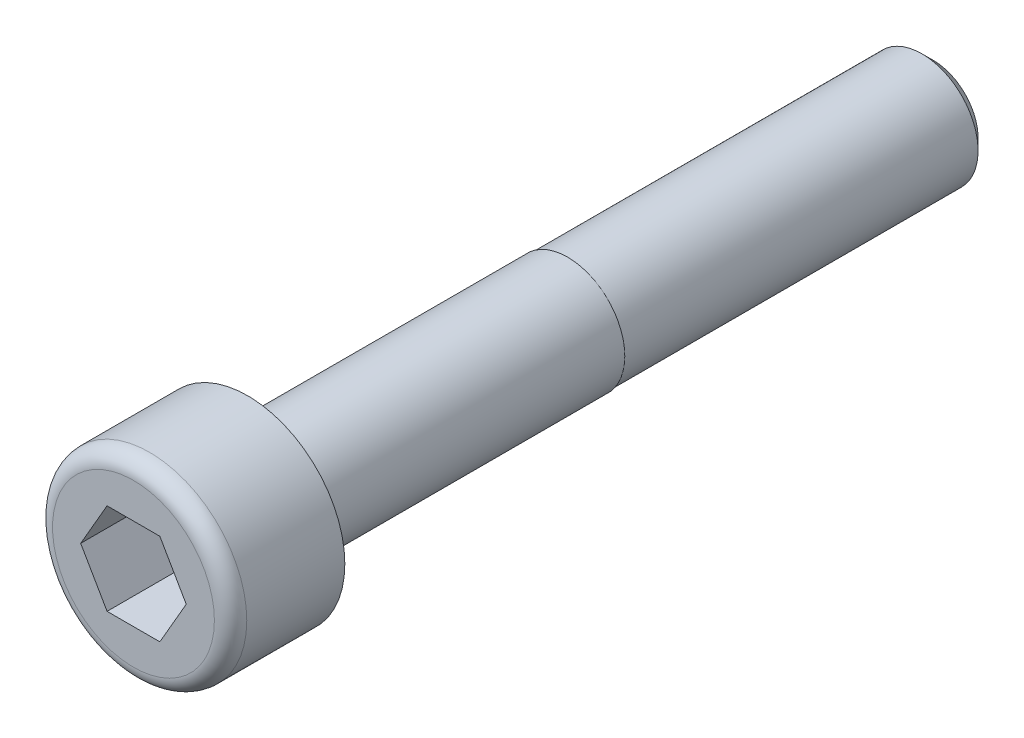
from build123d import *

# Parameters (mm, degrees)
ESQUISSE1_R             = 4.25
BASE_EXTRUSION_DEPTH    = 5
ESQUISSE2_R             = 2.5
BOSS_EXTRU_1_DEPTH      = 14
ENL_V_MAT_EXTRU_1_DEPTH = 5
ESQUISSE6_R             = 2.45
BOSS_EXTRU_3_DEPTH      = 16
CHANFREIN3_SIZE         = 0.49
CONG_1_R                = 0.708333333


with BuildPart() as part:
    # Esquisse1 → Base-Extrusion (new body)
    with BuildSketch(Plane.XY):
        Circle(ESQUISSE1_R)
    extrude(amount=BASE_EXTRUSION_DEPTH)

    # Esquisse2 → Boss.-Extru.1 (add)
    with BuildSketch(Plane(origin=(0, 0, 0), x_dir=(-1, 0, 0), z_dir=(0, 0, -1))):
        with Locations(Location((0, 0, 0), (0, 0, 180))):
            Circle(ESQUISSE2_R)
    extrude(amount=BOSS_EXTRU_1_DEPTH)

    # Esquisse3 → Enl_v. mat.-Extru.1 (cut)
    with BuildSketch(Plane.XY.offset(5)):
        Polygon((2.309401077, 0), (1.154700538, 2), (-1.154700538, 2), (-2.309401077, 0), (-1.154700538, -2), (1.154700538, -2), align=None)
    extrude(amount=-ENL_V_MAT_EXTRU_1_DEPTH, mode=Mode.SUBTRACT)

    # Esquisse6 → Boss.-Extru.3 (add)
    with BuildSketch(Plane(origin=(0, 0, -14), x_dir=(-1, 0, 0), z_dir=(0, 0, -1))):
        Circle(ESQUISSE6_R)
    extrude(amount=BOSS_EXTRU_3_DEPTH)

    # Chanfrein3
    chanfrein3_edges = [part.edges().sort_by_distance(p)[0] for p in [
        (2.45, 0, -30),
    ]]
    chamfer(chanfrein3_edges, length=CHANFREIN3_SIZE)

    # Cong_1
    cong_1_edges = [part.edges().sort_by_distance(p)[0] for p in [
        (-4.25, 0, 5),
    ]]
    fillet(cong_1_edges, radius=CONG_1_R)


solid = part.part
